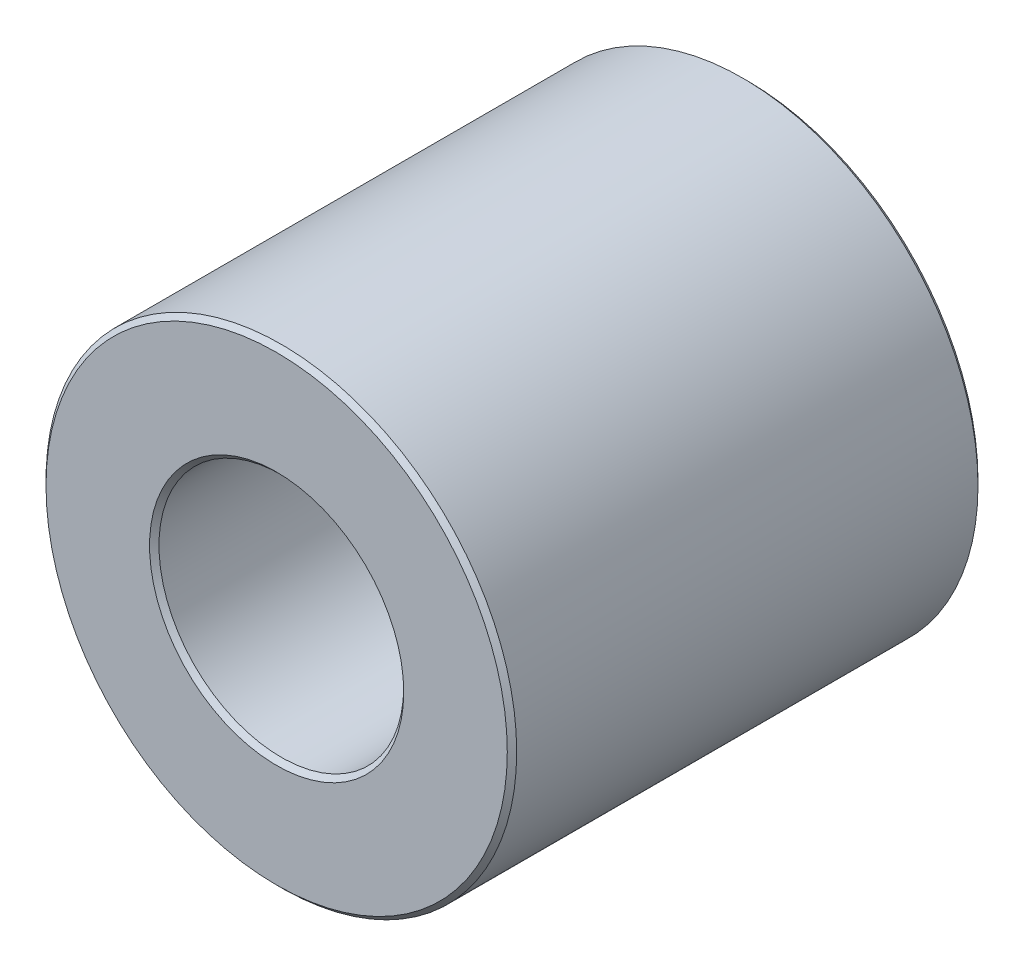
from build123d import *

# Parameters (mm, degrees)
SKETCH1_R           = 5
SKETCH1_R_2         = 2.6
BOSS_EXTRUDE2_DEPTH = 5
CHAMFER3_SIZE       = 0.1


with BuildPart() as part:
    # Sketch1 → Boss-Extrude2 (new, symmetric)
    with BuildSketch(Plane.XY):
        Circle(SKETCH1_R)
        Circle(SKETCH1_R_2, mode=Mode.SUBTRACT)
    extrude(amount=BOSS_EXTRUDE2_DEPTH, both=True)

    # Chamfer3
    chamfer3_edges = [part.edges().sort_by_distance(p)[0] for p in [
        (-5, 0, -5),
        (-5, 0, 5),
        (-2.6, 0, -5),
        (-2.6, 0, 5),
    ]]
    chamfer(chamfer3_edges, length=CHAMFER3_SIZE)


solid = part.part
